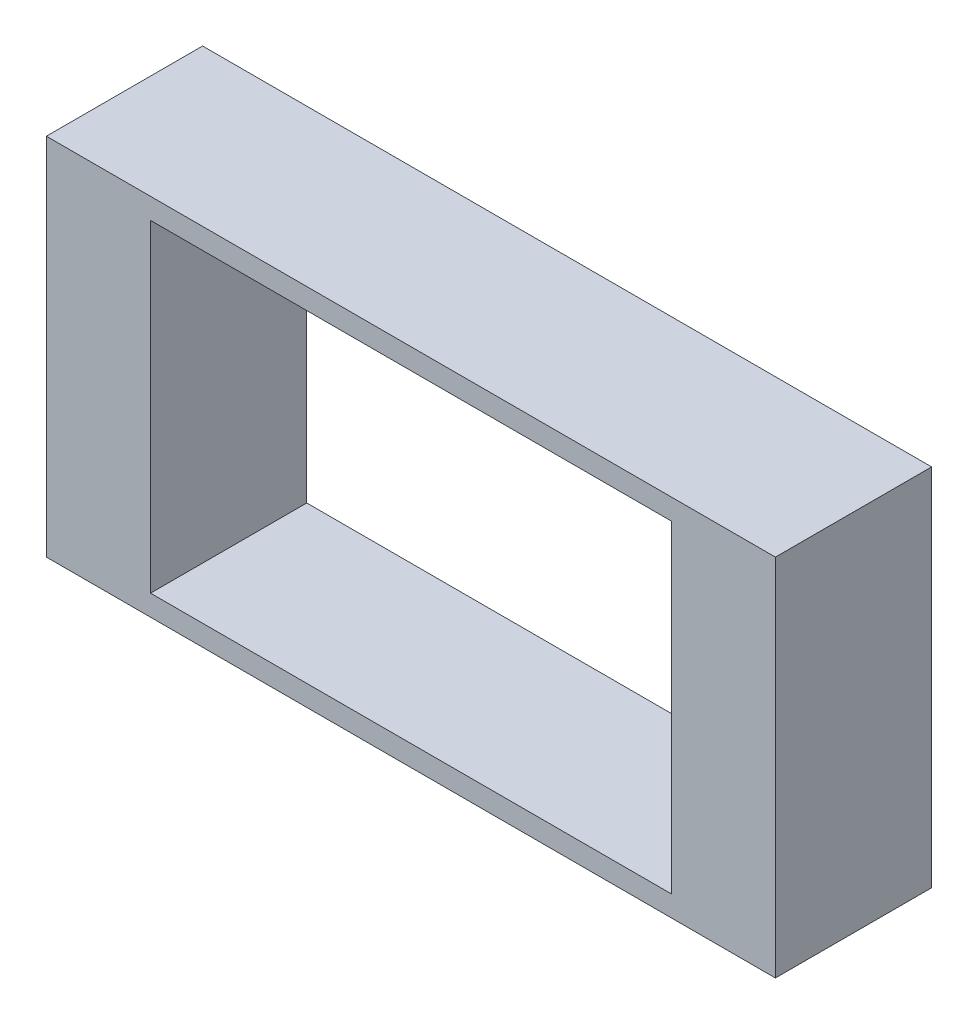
from build123d import *

# Parameters (mm, degrees)
ESQUISSE1_W        = 70
ESQUISSE1_H        = 35
ESQUISSE1_W_2      = 50
ESQUISSE1_H_2      = 31
BOSS_EXTRU_1_DEPTH = 15


with BuildPart() as part:
    # Esquisse1 → Boss.-Extru.1 (new body)
    with BuildSketch(Plane.XY):
        Rectangle(ESQUISSE1_W, ESQUISSE1_H)
        Rectangle(ESQUISSE1_W_2, ESQUISSE1_H_2, mode=Mode.SUBTRACT)
    extrude(amount=BOSS_EXTRU_1_DEPTH)


solid = part.part
